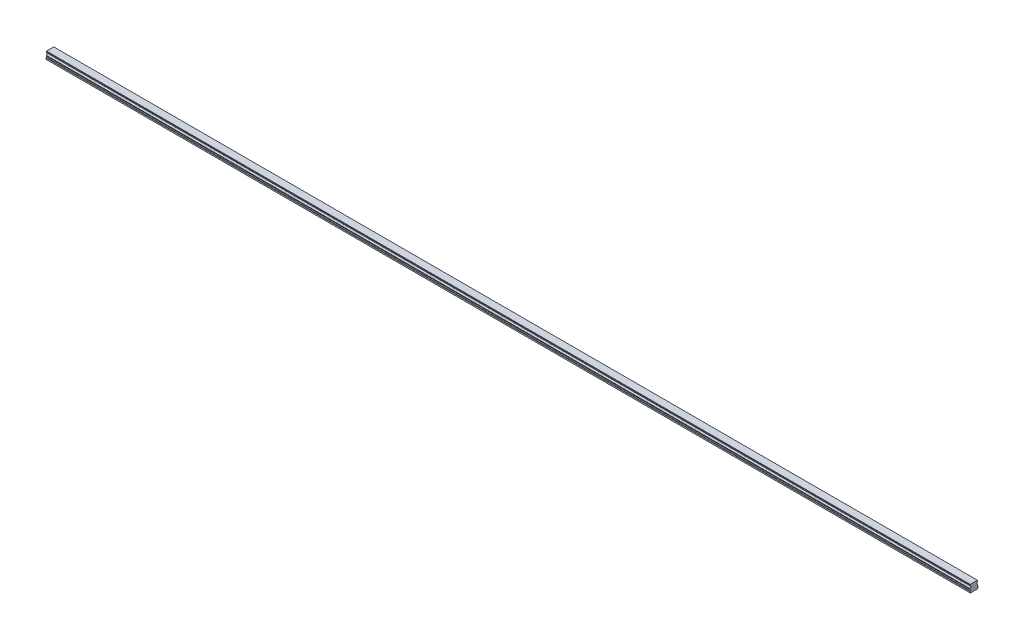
from build123d import *

# Parameters (mm, degrees)
BOSS_EXTRUDE1_DEPTH        = 1680
SKETCH3_R                  = 2.5
SKETCH3_R_2                = 2.1
CUT_EXTRUDE3_DEPTH         = 7
SKETCH3_2_R                = 2.1
CUT_EXTRUDE4_DEPTH         = 9.5
CHAMFER1_SIZE              = 0.4
LPATTERN2_COUNT            = 28
LPATTERN2_PITCH            = 60
CHAMFER1_OF_LPATTERN2_SIZE = 0.4


with BuildPart() as part:
    # Sketch1 → Boss-Extrude1 (new body)
    with BuildSketch(Plane(origin=(0, 0, 0), x_dir=(0, 0, -1), z_dir=(1, 0, 0))):
        with BuildLine():
            Line((6.59, 14), (-6.59, 14))
            Line((-6.59, 14), (-6.59, 13.15))
            Line((-6.59, 13.15), (-6.96, 12.356532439))
            Line((-6.96, 12.356532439), (-6.96, 11.435174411))
            ThreePointArc((-6.96, 11.435174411), (-5.25, 9.5), (-6.96, 7.564825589))
            Line((-6.96, 7.564825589), (-6.96, 6.643467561))
            Line((-6.96, 6.643467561), (-6.59, 5.85))
            Line((-6.59, 5.85), (-7.032116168, 4.2))
            Line((-7.032116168, 4.2), (-7.5, 3.929867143))
            Line((-7.5, 3.929867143), (-7.5, 1.4))
            Line((-7.5, 1.4), (-6.1, 0))
            Line((-6.1, 0), (-3.65, 0))
            Line((-3.65, 0), (-3.25, 0.4))
            Line((-3.25, 0.4), (3.25, 0.4))
            Line((3.25, 0.4), (3.65, 0))
            Line((3.65, 0), (6.1, 0))
            Line((6.1, 0), (7.5, 1.4))
            Line((7.5, 1.4), (7.5, 3.929867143))
            Line((7.5, 3.929867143), (7.032116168, 4.2))
            Line((7.032116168, 4.2), (6.59, 5.85))
            Line((6.59, 5.85), (6.96, 6.643467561))
            Line((6.96, 6.643467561), (6.96, 7.564825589))
            ThreePointArc((6.96, 7.564825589), (5.25, 9.5), (6.96, 11.435174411))
            Line((6.96, 11.435174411), (6.96, 12.356532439))
            Line((6.96, 12.356532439), (6.59, 13.15))
            Line((6.59, 13.15), (6.59, 14))
        make_face()
    extrude(amount=BOSS_EXTRUDE1_DEPTH)

    # Sketch3 → Cut-Extrude3 (cut)
    with BuildSketch(Plane.XZ):
        with Locations(Location((30, 0, 0), (0, 0, 270))):
            Circle(SKETCH3_R)
        with Locations(Location((30, 0, 0), (0, 0, 270))):
            Circle(SKETCH3_R_2, mode=Mode.SUBTRACT)
    cut_extrude3 = extrude(amount=-CUT_EXTRUDE3_DEPTH, mode=Mode.SUBTRACT)

    # Sketch3_2 → Cut-Extrude4 (cut)
    with BuildSketch(Plane.XZ):
        with Locations(Location((30, 0, 0), (0, 0, 270))):
            Circle(SKETCH3_2_R)
    cut_extrude4 = extrude(amount=-CUT_EXTRUDE4_DEPTH, mode=Mode.SUBTRACT)

    # Cut-Extrude5 cone 1 section (on through the dimple's axis) → Cut-Extrude5 (revolve, cut)
    with BuildSketch(Plane(origin=(30, 9.5, 0), x_dir=(0, 0, -1), z_dir=(1, 0, 0))):
        Polygon((0, 0), (2.1, 0), (0, 1.212435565), align=None)
    revolve(axis=Axis((30, 9.5, 0), (0, 1, 0)), mode=Mode.SUBTRACT)

    # Chamfer1
    chamfer1_edges = [part.edges().sort_by_distance(p)[0] for p in [
        (30, 0.4, 2.5),
    ]]
    chamfer(chamfer1_edges, length=CHAMFER1_SIZE)

    # LPattern2: Cut-Extrude3, Cut-Extrude4 ×28
    with Locations(*[(i * LPATTERN2_PITCH, 0, 0) for i in range(1, LPATTERN2_COUNT)]):
        add(cut_extrude3, mode=Mode.SUBTRACT)
        add(cut_extrude4, mode=Mode.SUBTRACT)

    # Chamfer1 of LPattern2
    chamfer1_of_lpattern2_edges = [part.edges().sort_by_distance(p)[0] for p in [
        (90, 0.4, 2.5),
        (150, 0.4, 2.5),
        (210, 0.4, 2.5),
        (270, 0.4, 2.5),
        (330, 0.4, 2.5),
        (390, 0.4, 2.5),
        (450, 0.4, 2.5),
        (510, 0.4, 2.5),
        (570, 0.4, 2.5),
        (630, 0.4, 2.5),
        (690, 0.4, 2.5),
        (750, 0.4, 2.5),
        (810, 0.4, 2.5),
        (870, 0.4, 2.5),
        (930, 0.4, 2.5),
        (990, 0.4, 2.5),
        (1050, 0.4, 2.5),
        (1110, 0.4, 2.5),
        (1170, 0.4, 2.5),
        (1230, 0.4, 2.5),
        (1290, 0.4, 2.5),
        (1350, 0.4, 2.5),
        (1410, 0.4, 2.5),
        (1470, 0.4, 2.5),
        (1530, 0.4, 2.5),
        (1590, 0.4, 2.5),
        (1650, 0.4, 2.5),
    ]]
    chamfer(chamfer1_of_lpattern2_edges, length=CHAMFER1_OF_LPATTERN2_SIZE)


solid = part.part
